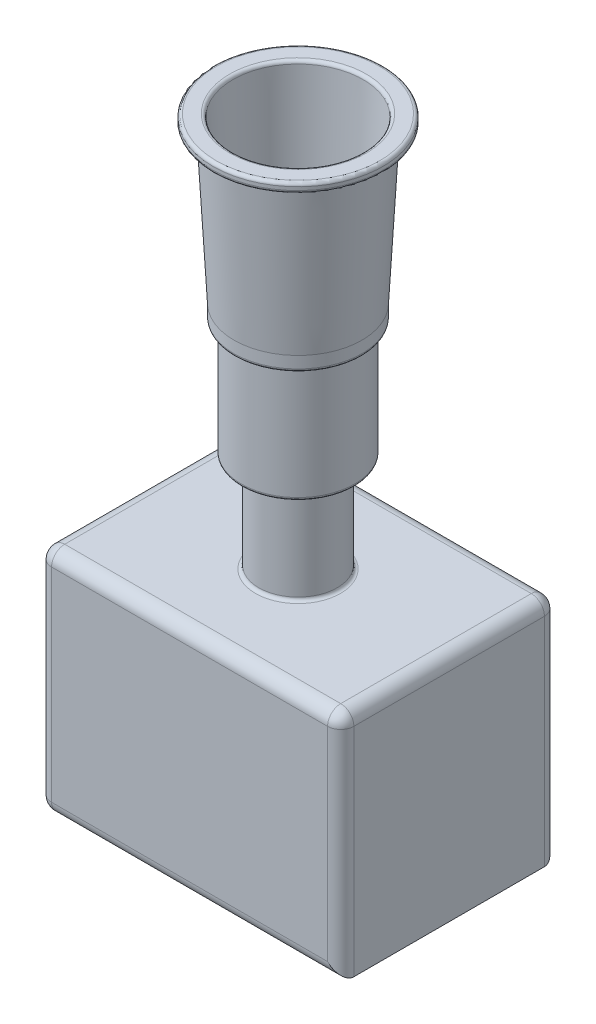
ISO-10303-21;
HEADER;
FILE_DESCRIPTION(('STEP AP214'),'2;1');
FILE_NAME('part.step','',(''),(''),'','','');
FILE_SCHEMA(('AUTOMOTIVE_DESIGN { 1 0 10303 214 1 1 1 1 }'));
ENDSEC;
DATA;
#1=APPLICATION_CONTEXT('core data for automotive mechanical design processes');
#2=APPLICATION_PROTOCOL_DEFINITION('international standard','automotive_design',2000,#1);
#3=PRODUCT_CONTEXT('',#1,'mechanical');
#4=PRODUCT('Part','Part','',(#3));
#5=PRODUCT_RELATED_PRODUCT_CATEGORY('part','',(#4));
#6=PRODUCT_DEFINITION_FORMATION('','',#4);
#7=PRODUCT_DEFINITION_CONTEXT('part definition',#1,'design');
#8=PRODUCT_DEFINITION('design','',#6,#7);
#9=PRODUCT_DEFINITION_SHAPE('','',#8);
#10=(LENGTH_UNIT() NAMED_UNIT(*) SI_UNIT(.MILLI.,.METRE.));
#11=(NAMED_UNIT(*) PLANE_ANGLE_UNIT() SI_UNIT($,.RADIAN.));
#12=(NAMED_UNIT(*) SI_UNIT($,.STERADIAN.) SOLID_ANGLE_UNIT());
#13=UNCERTAINTY_MEASURE_WITH_UNIT(LENGTH_MEASURE(1.E-05),#10,'distance_accuracy_value','');
#14=(GEOMETRIC_REPRESENTATION_CONTEXT(3) GLOBAL_UNCERTAINTY_ASSIGNED_CONTEXT((#13)) GLOBAL_UNIT_ASSIGNED_CONTEXT((#10,
#11,#12)) REPRESENTATION_CONTEXT('',''));
#15=CARTESIAN_POINT('',(0.,0.,0.));
#16=DIRECTION('',(0.,0.,1.));
#17=DIRECTION('',(1.,0.,0.));
#18=AXIS2_PLACEMENT_3D('',#15,#16,#17);
#19=CARTESIAN_POINT('',(-21.,2.,-14.5));
#20=DIRECTION('',(-0.577350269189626,-0.577350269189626,-0.577350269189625));
#21=DIRECTION('',(-0.707106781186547,0.707106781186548,0.));
#22=AXIS2_PLACEMENT_3D('',#19,#20,#21);
#23=SPHERICAL_SURFACE('',#22,2.);
#24=CARTESIAN_POINT('',(-22.1547005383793,0.845299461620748,-15.6547005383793));
#25=VERTEX_POINT('',#24);
#26=VERTEX_LOOP('',#25);
#27=FACE_BOUND('',#26,.T.);
#28=CARTESIAN_POINT('',(-21.,2.,-14.5));
#29=DIRECTION('',(0.,1.,0.));
#30=DIRECTION('',(0.,0.,1.));
#31=AXIS2_PLACEMENT_3D('',#28,#29,#30);
#32=CIRCLE('',#31,2.);
#33=CARTESIAN_POINT('',(-21.,2.,-16.5));
#34=VERTEX_POINT('',#33);
#35=CARTESIAN_POINT('',(-23.,2.,-14.5));
#36=VERTEX_POINT('',#35);
#37=EDGE_CURVE('E110',#34,#36,#32,.T.);
#38=ORIENTED_EDGE('',*,*,#37,.F.);
#39=CARTESIAN_POINT('',(-21.,2.,-14.5));
#40=DIRECTION('',(-1.,0.,0.));
#41=DIRECTION('',(0.,0.,1.));
#42=AXIS2_PLACEMENT_3D('',#39,#40,#41);
#43=CIRCLE('',#42,2.);
#44=CARTESIAN_POINT('',(-21.,0.,-14.5));
#45=VERTEX_POINT('',#44);
#46=EDGE_CURVE('E21',#45,#34,#43,.F.);
#47=ORIENTED_EDGE('',*,*,#46,.F.);
#48=CARTESIAN_POINT('',(-21.,2.,-14.5));
#49=DIRECTION('',(0.,0.,1.));
#50=DIRECTION('',(1.,0.,0.));
#51=AXIS2_PLACEMENT_3D('',#48,#49,#50);
#52=CIRCLE('',#51,2.);
#53=EDGE_CURVE('E107',#36,#45,#52,.T.);
#54=ORIENTED_EDGE('',*,*,#53,.F.);
#55=EDGE_LOOP('',(#38,#47,#54));
#56=FACE_BOUND('',#55,.T.);
#57=ADVANCED_FACE('F17',(#27,#56),#23,.T.);
#58=CARTESIAN_POINT('',(-21.,2.,14.5));
#59=DIRECTION('',(-0.577350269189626,-0.577350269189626,0.577350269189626));
#60=DIRECTION('',(-0.707106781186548,0.707106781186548,0.));
#61=AXIS2_PLACEMENT_3D('',#58,#59,#60);
#62=SPHERICAL_SURFACE('',#61,2.);
#63=CARTESIAN_POINT('',(-22.1547005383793,0.845299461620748,15.6547005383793));
#64=VERTEX_POINT('',#63);
#65=VERTEX_LOOP('',#64);
#66=FACE_BOUND('',#65,.T.);
#67=CARTESIAN_POINT('',(-21.,2.,14.5));
#68=DIRECTION('',(1.,0.,0.));
#69=DIRECTION('',(0.,0.,-1.));
#70=AXIS2_PLACEMENT_3D('',#67,#68,#69);
#71=CIRCLE('',#70,2.);
#72=CARTESIAN_POINT('',(-21.,2.,16.5));
#73=VERTEX_POINT('',#72);
#74=CARTESIAN_POINT('',(-21.,0.,14.5));
#75=VERTEX_POINT('',#74);
#76=EDGE_CURVE('E442',#73,#75,#71,.T.);
#77=ORIENTED_EDGE('',*,*,#76,.F.);
#78=CARTESIAN_POINT('',(-21.,2.,14.5));
#79=DIRECTION('',(0.,1.,0.));
#80=DIRECTION('',(0.,0.,1.));
#81=AXIS2_PLACEMENT_3D('',#78,#79,#80);
#82=CIRCLE('',#81,2.);
#83=CARTESIAN_POINT('',(-23.,2.,14.5));
#84=VERTEX_POINT('',#83);
#85=EDGE_CURVE('E439',#84,#73,#82,.T.);
#86=ORIENTED_EDGE('',*,*,#85,.F.);
#87=CARTESIAN_POINT('',(-21.,2.,14.5));
#88=DIRECTION('',(0.,0.,1.));
#89=DIRECTION('',(1.,0.,0.));
#90=AXIS2_PLACEMENT_3D('',#87,#88,#89);
#91=CIRCLE('',#90,2.);
#92=EDGE_CURVE('E132',#75,#84,#91,.F.);
#93=ORIENTED_EDGE('',*,*,#92,.F.);
#94=EDGE_LOOP('',(#77,#86,#93));
#95=FACE_BOUND('',#94,.T.);
#96=ADVANCED_FACE('F145',(#66,#95),#62,.T.);
#97=CARTESIAN_POINT('',(11.5,2.,-14.5));
#98=DIRECTION('',(-1.,0.,0.));
#99=DIRECTION('',(0.,0.,1.));
#100=AXIS2_PLACEMENT_3D('',#97,#98,#99);
#101=CYLINDRICAL_SURFACE('',#100,2.);
#102=CARTESIAN_POINT('',(21.,2.,-14.5));
#103=DIRECTION('',(0.707106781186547,0.707106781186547,0.));
#104=DIRECTION('',(-0.707106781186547,0.707106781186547,0.));
#105=AXIS2_PLACEMENT_3D('',#102,#103,#104);
#106=ELLIPSE('',#105,2.82842712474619,2.);
#107=CARTESIAN_POINT('',(23.,0.,-14.5));
#108=VERTEX_POINT('',#107);
#109=CARTESIAN_POINT('',(21.,2.,-16.5));
#110=VERTEX_POINT('',#109);
#111=EDGE_CURVE('E117',#108,#110,#106,.T.);
#112=ORIENTED_EDGE('',*,*,#111,.F.);
#113=DIRECTION('',(1.,0.,0.));
#114=VECTOR('',#113,1.);
#115=CARTESIAN_POINT('',(0.,0.,-14.5));
#116=LINE('',#115,#114);
#117=EDGE_CURVE('E114',#108,#45,#116,.F.);
#118=ORIENTED_EDGE('',*,*,#117,.T.);
#119=ORIENTED_EDGE('',*,*,#46,.T.);
#120=DIRECTION('',(-1.,0.,0.));
#121=VECTOR('',#120,1.);
#122=CARTESIAN_POINT('',(23.,2.,-16.5));
#123=LINE('',#122,#121);
#124=EDGE_CURVE('E135',#110,#34,#123,.T.);
#125=ORIENTED_EDGE('',*,*,#124,.F.);
#126=EDGE_LOOP('',(#112,#118,#119,#125));
#127=FACE_BOUND('',#126,.T.);
#128=ADVANCED_FACE('F115',(#127),#101,.T.);
#129=CARTESIAN_POINT('',(-21.,2.,-8.25));
#130=DIRECTION('',(0.,0.,1.));
#131=DIRECTION('',(1.,0.,0.));
#132=AXIS2_PLACEMENT_3D('',#129,#130,#131);
#133=CYLINDRICAL_SURFACE('',#132,2.);
#134=ORIENTED_EDGE('',*,*,#92,.T.);
#135=DIRECTION('',(0.,0.,1.));
#136=VECTOR('',#135,1.);
#137=CARTESIAN_POINT('',(-23.,2.,-16.5));
#138=LINE('',#137,#136);
#139=EDGE_CURVE('E131',#36,#84,#138,.T.);
#140=ORIENTED_EDGE('',*,*,#139,.F.);
#141=ORIENTED_EDGE('',*,*,#53,.T.);
#142=DIRECTION('',(0.,0.,1.));
#143=VECTOR('',#142,1.);
#144=CARTESIAN_POINT('',(-21.,0.,0.));
#145=LINE('',#144,#143);
#146=EDGE_CURVE('E122',#45,#75,#145,.T.);
#147=ORIENTED_EDGE('',*,*,#146,.T.);
#148=EDGE_LOOP('',(#134,#140,#141,#147));
#149=FACE_BOUND('',#148,.T.);
#150=ADVANCED_FACE('F128',(#149),#133,.T.);
#151=CARTESIAN_POINT('',(-21.,0.,-14.5));
#152=DIRECTION('',(0.,1.,0.));
#153=DIRECTION('',(0.,0.,1.));
#154=AXIS2_PLACEMENT_3D('',#151,#152,#153);
#155=CYLINDRICAL_SURFACE('',#154,2.);
#156=CARTESIAN_POINT('',(-21.,33.,-14.5));
#157=DIRECTION('',(0.,1.,0.));
#158=DIRECTION('',(0.,0.,1.));
#159=AXIS2_PLACEMENT_3D('',#156,#157,#158);
#160=CIRCLE('',#159,2.);
#161=CARTESIAN_POINT('',(-21.,33.,-16.5));
#162=VERTEX_POINT('',#161);
#163=CARTESIAN_POINT('',(-23.,33.,-14.5));
#164=VERTEX_POINT('',#163);
#165=EDGE_CURVE('E419',#162,#164,#160,.T.);
#166=ORIENTED_EDGE('',*,*,#165,.F.);
#167=DIRECTION('',(0.,1.,0.));
#168=VECTOR('',#167,1.);
#169=CARTESIAN_POINT('',(-21.,0.,-16.5));
#170=LINE('',#169,#168);
#171=EDGE_CURVE('E420',#34,#162,#170,.T.);
#172=ORIENTED_EDGE('',*,*,#171,.F.);
#173=ORIENTED_EDGE('',*,*,#37,.T.);
#174=DIRECTION('',(0.,1.,0.));
#175=VECTOR('',#174,1.);
#176=CARTESIAN_POINT('',(-23.,0.,-14.5));
#177=LINE('',#176,#175);
#178=EDGE_CURVE('E404',#164,#36,#177,.F.);
#179=ORIENTED_EDGE('',*,*,#178,.F.);
#180=EDGE_LOOP('',(#166,#172,#173,#179));
#181=FACE_BOUND('',#180,.T.);
#182=ADVANCED_FACE('F850',(#181),#155,.T.);
#183=CARTESIAN_POINT('',(-11.5,2.,14.5));
#184=DIRECTION('',(1.,0.,0.));
#185=DIRECTION('',(0.,0.,-1.));
#186=AXIS2_PLACEMENT_3D('',#183,#184,#185);
#187=CYLINDRICAL_SURFACE('',#186,2.);
#188=CARTESIAN_POINT('',(21.,2.,14.5));
#189=DIRECTION('',(0.707106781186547,0.707106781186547,0.));
#190=DIRECTION('',(-0.707106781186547,0.707106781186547,0.));
#191=AXIS2_PLACEMENT_3D('',#188,#189,#190);
#192=ELLIPSE('',#191,2.82842712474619,2.);
#193=CARTESIAN_POINT('',(21.,2.,16.5));
#194=VERTEX_POINT('',#193);
#195=CARTESIAN_POINT('',(23.,0.,14.5));
#196=VERTEX_POINT('',#195);
#197=EDGE_CURVE('E426',#194,#196,#192,.T.);
#198=ORIENTED_EDGE('',*,*,#197,.F.);
#199=DIRECTION('',(1.,0.,0.));
#200=VECTOR('',#199,1.);
#201=CARTESIAN_POINT('',(-23.,2.,16.5));
#202=LINE('',#201,#200);
#203=EDGE_CURVE('E427',#73,#194,#202,.T.);
#204=ORIENTED_EDGE('',*,*,#203,.F.);
#205=ORIENTED_EDGE('',*,*,#76,.T.);
#206=DIRECTION('',(1.,0.,0.));
#207=VECTOR('',#206,1.);
#208=CARTESIAN_POINT('',(0.,0.,14.5));
#209=LINE('',#208,#207);
#210=EDGE_CURVE('E123',#75,#196,#209,.T.);
#211=ORIENTED_EDGE('',*,*,#210,.T.);
#212=EDGE_LOOP('',(#198,#204,#205,#211));
#213=FACE_BOUND('',#212,.T.);
#214=ADVANCED_FACE('F858',(#213),#187,.T.);
#215=CARTESIAN_POINT('',(-21.,0.,14.5));
#216=DIRECTION('',(0.,1.,0.));
#217=DIRECTION('',(0.,0.,1.));
#218=AXIS2_PLACEMENT_3D('',#215,#216,#217);
#219=CYLINDRICAL_SURFACE('',#218,2.);
#220=CARTESIAN_POINT('',(-21.,33.,14.5));
#221=DIRECTION('',(0.,1.,0.));
#222=DIRECTION('',(0.,0.,1.));
#223=AXIS2_PLACEMENT_3D('',#220,#221,#222);
#224=CIRCLE('',#223,2.);
#225=CARTESIAN_POINT('',(-23.,33.,14.5));
#226=VERTEX_POINT('',#225);
#227=CARTESIAN_POINT('',(-21.,33.,16.5));
#228=VERTEX_POINT('',#227);
#229=EDGE_CURVE('E407',#226,#228,#224,.T.);
#230=ORIENTED_EDGE('',*,*,#229,.F.);
#231=DIRECTION('',(0.,1.,0.));
#232=VECTOR('',#231,1.);
#233=CARTESIAN_POINT('',(-23.,0.,14.5));
#234=LINE('',#233,#232);
#235=EDGE_CURVE('E408',#84,#226,#234,.T.);
#236=ORIENTED_EDGE('',*,*,#235,.F.);
#237=ORIENTED_EDGE('',*,*,#85,.T.);
#238=DIRECTION('',(0.,1.,0.));
#239=VECTOR('',#238,1.);
#240=CARTESIAN_POINT('',(-21.,0.,16.5));
#241=LINE('',#240,#239);
#242=EDGE_CURVE('E473',#228,#73,#241,.F.);
#243=ORIENTED_EDGE('',*,*,#242,.F.);
#244=EDGE_LOOP('',(#230,#236,#237,#243));
#245=FACE_BOUND('',#244,.T.);
#246=ADVANCED_FACE('F449',(#245),#219,.T.);
#247=CARTESIAN_POINT('',(21.,0.,14.5));
#248=DIRECTION('',(0.,1.,0.));
#249=DIRECTION('',(0.,0.,1.));
#250=AXIS2_PLACEMENT_3D('',#247,#248,#249);
#251=CYLINDRICAL_SURFACE('',#250,2.);
#252=DIRECTION('',(0.,1.,0.));
#253=VECTOR('',#252,1.);
#254=CARTESIAN_POINT('',(21.,0.,16.5));
#255=LINE('',#254,#253);
#256=CARTESIAN_POINT('',(21.,33.,16.5));
#257=VERTEX_POINT('',#256);
#258=EDGE_CURVE('E397',#194,#257,#255,.T.);
#259=ORIENTED_EDGE('',*,*,#258,.F.);
#260=ORIENTED_EDGE('',*,*,#197,.T.);
#261=DIRECTION('',(0.,1.,0.));
#262=VECTOR('',#261,1.);
#263=CARTESIAN_POINT('',(23.,0.,14.5));
#264=LINE('',#263,#262);
#265=CARTESIAN_POINT('',(23.,33.,14.5));
#266=VERTEX_POINT('',#265);
#267=EDGE_CURVE('E364',#266,#196,#264,.F.);
#268=ORIENTED_EDGE('',*,*,#267,.F.);
#269=CARTESIAN_POINT('',(21.,33.,14.5));
#270=DIRECTION('',(0.,1.,0.));
#271=DIRECTION('',(0.,0.,1.));
#272=AXIS2_PLACEMENT_3D('',#269,#270,#271);
#273=CIRCLE('',#272,2.);
#274=EDGE_CURVE('E469',#257,#266,#273,.T.);
#275=ORIENTED_EDGE('',*,*,#274,.F.);
#276=EDGE_LOOP('',(#259,#260,#268,#275));
#277=FACE_BOUND('',#276,.T.);
#278=ADVANCED_FACE('F739',(#277),#251,.T.);
#279=CARTESIAN_POINT('',(0.,0.,0.));
#280=DIRECTION('',(0.,1.,0.));
#281=DIRECTION('',(0.,0.,1.));
#282=AXIS2_PLACEMENT_3D('',#279,#280,#281);
#283=PLANE('',#282);
#284=ORIENTED_EDGE('',*,*,#117,.F.);
#285=DIRECTION('',(0.,0.,-1.));
#286=VECTOR('',#285,1.);
#287=CARTESIAN_POINT('',(23.,0.,16.5));
#288=LINE('',#287,#286);
#289=EDGE_CURVE('E370',#196,#108,#288,.T.);
#290=ORIENTED_EDGE('',*,*,#289,.F.);
#291=ORIENTED_EDGE('',*,*,#210,.F.);
#292=ORIENTED_EDGE('',*,*,#146,.F.);
#293=EDGE_LOOP('',(#284,#290,#291,#292));
#294=FACE_BOUND('',#293,.T.);
#295=ADVANCED_FACE('F133',(#294),#283,.F.);
#296=CARTESIAN_POINT('',(21.,0.,-14.5));
#297=DIRECTION('',(0.,1.,0.));
#298=DIRECTION('',(0.,0.,1.));
#299=AXIS2_PLACEMENT_3D('',#296,#297,#298);
#300=CYLINDRICAL_SURFACE('',#299,2.);
#301=DIRECTION('',(0.,1.,0.));
#302=VECTOR('',#301,1.);
#303=CARTESIAN_POINT('',(23.,0.,-14.5));
#304=LINE('',#303,#302);
#305=CARTESIAN_POINT('',(23.,33.,-14.5));
#306=VERTEX_POINT('',#305);
#307=EDGE_CURVE('E366',#108,#306,#304,.T.);
#308=ORIENTED_EDGE('',*,*,#307,.F.);
#309=ORIENTED_EDGE('',*,*,#111,.T.);
#310=DIRECTION('',(0.,1.,0.));
#311=VECTOR('',#310,1.);
#312=CARTESIAN_POINT('',(21.,0.,-16.5));
#313=LINE('',#312,#311);
#314=CARTESIAN_POINT('',(21.,33.,-16.5));
#315=VERTEX_POINT('',#314);
#316=EDGE_CURVE('E416',#315,#110,#313,.F.);
#317=ORIENTED_EDGE('',*,*,#316,.F.);
#318=CARTESIAN_POINT('',(21.,33.,-14.5));
#319=DIRECTION('',(0.,1.,0.));
#320=DIRECTION('',(0.,0.,1.));
#321=AXIS2_PLACEMENT_3D('',#318,#319,#320);
#322=CIRCLE('',#321,2.);
#323=EDGE_CURVE('E471',#306,#315,#322,.T.);
#324=ORIENTED_EDGE('',*,*,#323,.F.);
#325=EDGE_LOOP('',(#308,#309,#317,#324));
#326=FACE_BOUND('',#325,.T.);
#327=ADVANCED_FACE('F727',(#326),#300,.T.);
#328=CARTESIAN_POINT('',(23.,0.,-16.5));
#329=DIRECTION('',(0.,0.,-1.));
#330=DIRECTION('',(-1.,0.,0.));
#331=AXIS2_PLACEMENT_3D('',#328,#329,#330);
#332=PLANE('',#331);
#333=DIRECTION('',(-1.,0.,0.));
#334=VECTOR('',#333,1.);
#335=CARTESIAN_POINT('',(11.5,33.,-16.5));
#336=LINE('',#335,#334);
#337=EDGE_CURVE('E411',#315,#162,#336,.T.);
#338=ORIENTED_EDGE('',*,*,#337,.F.);
#339=ORIENTED_EDGE('',*,*,#316,.T.);
#340=ORIENTED_EDGE('',*,*,#124,.T.);
#341=ORIENTED_EDGE('',*,*,#171,.T.);
#342=EDGE_LOOP('',(#338,#339,#340,#341));
#343=FACE_BOUND('',#342,.T.);
#344=ADVANCED_FACE('F391',(#343),#332,.T.);
#345=CARTESIAN_POINT('',(-21.,33.,-14.5));
#346=DIRECTION('',(-0.577350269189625,0.577350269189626,-0.577350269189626));
#347=DIRECTION('',(0.,-0.707106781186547,-0.707106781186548));
#348=AXIS2_PLACEMENT_3D('',#345,#346,#347);
#349=SPHERICAL_SURFACE('',#348,2.);
#350=CARTESIAN_POINT('',(-22.1547005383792,34.1547005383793,-15.6547005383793));
#351=VERTEX_POINT('',#350);
#352=VERTEX_LOOP('',#351);
#353=FACE_BOUND('',#352,.T.);
#354=ORIENTED_EDGE('',*,*,#165,.T.);
#355=CARTESIAN_POINT('',(-21.,33.,-14.5));
#356=DIRECTION('',(0.,0.,1.));
#357=DIRECTION('',(1.,0.,0.));
#358=AXIS2_PLACEMENT_3D('',#355,#356,#357);
#359=CIRCLE('',#358,2.);
#360=CARTESIAN_POINT('',(-21.,35.,-14.5));
#361=VERTEX_POINT('',#360);
#362=EDGE_CURVE('E403',#361,#164,#359,.T.);
#363=ORIENTED_EDGE('',*,*,#362,.F.);
#364=CARTESIAN_POINT('',(-21.,33.,-14.5));
#365=DIRECTION('',(-1.,0.,0.));
#366=DIRECTION('',(0.,0.,1.));
#367=AXIS2_PLACEMENT_3D('',#364,#365,#366);
#368=CIRCLE('',#367,2.);
#369=EDGE_CURVE('E369',#162,#361,#368,.F.);
#370=ORIENTED_EDGE('',*,*,#369,.F.);
#371=EDGE_LOOP('',(#354,#363,#370));
#372=FACE_BOUND('',#371,.T.);
#373=ADVANCED_FACE('F386',(#353,#372),#349,.T.);
#374=CARTESIAN_POINT('',(-23.,0.,-16.5));
#375=DIRECTION('',(-1.,0.,0.));
#376=DIRECTION('',(0.,0.,1.));
#377=AXIS2_PLACEMENT_3D('',#374,#375,#376);
#378=PLANE('',#377);
#379=DIRECTION('',(0.,0.,1.));
#380=VECTOR('',#379,1.);
#381=CARTESIAN_POINT('',(-23.,33.,-8.25));
#382=LINE('',#381,#380);
#383=EDGE_CURVE('E399',#164,#226,#382,.T.);
#384=ORIENTED_EDGE('',*,*,#383,.F.);
#385=ORIENTED_EDGE('',*,*,#178,.T.);
#386=ORIENTED_EDGE('',*,*,#139,.T.);
#387=ORIENTED_EDGE('',*,*,#235,.T.);
#388=EDGE_LOOP('',(#384,#385,#386,#387));
#389=FACE_BOUND('',#388,.T.);
#390=ADVANCED_FACE('F382',(#389),#378,.T.);
#391=CARTESIAN_POINT('',(-21.,33.,14.5));
#392=DIRECTION('',(-0.577350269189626,0.577350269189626,0.577350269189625));
#393=DIRECTION('',(0.,0.707106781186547,-0.707106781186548));
#394=AXIS2_PLACEMENT_3D('',#391,#392,#393);
#395=SPHERICAL_SURFACE('',#394,2.);
#396=CARTESIAN_POINT('',(-22.1547005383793,34.1547005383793,15.6547005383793));
#397=VERTEX_POINT('',#396);
#398=VERTEX_LOOP('',#397);
#399=FACE_BOUND('',#398,.T.);
#400=ORIENTED_EDGE('',*,*,#229,.T.);
#401=CARTESIAN_POINT('',(-21.,33.,14.5));
#402=DIRECTION('',(1.,0.,0.));
#403=DIRECTION('',(0.,0.,-1.));
#404=AXIS2_PLACEMENT_3D('',#401,#402,#403);
#405=CIRCLE('',#404,2.);
#406=CARTESIAN_POINT('',(-21.,35.,14.5));
#407=VERTEX_POINT('',#406);
#408=EDGE_CURVE('E483',#407,#228,#405,.T.);
#409=ORIENTED_EDGE('',*,*,#408,.F.);
#410=CARTESIAN_POINT('',(-21.,33.,14.5));
#411=DIRECTION('',(0.,0.,1.));
#412=DIRECTION('',(1.,0.,0.));
#413=AXIS2_PLACEMENT_3D('',#410,#411,#412);
#414=CIRCLE('',#413,2.);
#415=EDGE_CURVE('E414',#226,#407,#414,.F.);
#416=ORIENTED_EDGE('',*,*,#415,.F.);
#417=EDGE_LOOP('',(#400,#409,#416));
#418=FACE_BOUND('',#417,.T.);
#419=ADVANCED_FACE('F379',(#399,#418),#395,.T.);
#420=CARTESIAN_POINT('',(-23.,0.,16.5));
#421=DIRECTION('',(0.,0.,1.));
#422=DIRECTION('',(1.,0.,0.));
#423=AXIS2_PLACEMENT_3D('',#420,#421,#422);
#424=PLANE('',#423);
#425=DIRECTION('',(1.,0.,0.));
#426=VECTOR('',#425,1.);
#427=CARTESIAN_POINT('',(-11.5,33.,16.5));
#428=LINE('',#427,#426);
#429=EDGE_CURVE('E480',#228,#257,#428,.T.);
#430=ORIENTED_EDGE('',*,*,#429,.F.);
#431=ORIENTED_EDGE('',*,*,#242,.T.);
#432=ORIENTED_EDGE('',*,*,#203,.T.);
#433=ORIENTED_EDGE('',*,*,#258,.T.);
#434=EDGE_LOOP('',(#430,#431,#432,#433));
#435=FACE_BOUND('',#434,.T.);
#436=ADVANCED_FACE('F358',(#435),#424,.T.);
#437=CARTESIAN_POINT('',(21.,33.,-14.5));
#438=DIRECTION('',(0.577350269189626,0.577350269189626,-0.577350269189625));
#439=DIRECTION('',(0.,-0.707106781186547,-0.707106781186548));
#440=AXIS2_PLACEMENT_3D('',#437,#438,#439);
#441=SPHERICAL_SURFACE('',#440,2.);
#442=CARTESIAN_POINT('',(22.1547005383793,34.1547005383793,-15.6547005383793));
#443=VERTEX_POINT('',#442);
#444=VERTEX_LOOP('',#443);
#445=FACE_BOUND('',#444,.T.);
#446=ORIENTED_EDGE('',*,*,#323,.T.);
#447=CARTESIAN_POINT('',(21.,33.,-14.5));
#448=DIRECTION('',(-1.,0.,0.));
#449=DIRECTION('',(0.,0.,1.));
#450=AXIS2_PLACEMENT_3D('',#447,#448,#449);
#451=CIRCLE('',#450,2.);
#452=CARTESIAN_POINT('',(21.,35.,-14.5));
#453=VERTEX_POINT('',#452);
#454=EDGE_CURVE('E415',#453,#315,#451,.T.);
#455=ORIENTED_EDGE('',*,*,#454,.F.);
#456=CARTESIAN_POINT('',(21.,33.,-14.5));
#457=DIRECTION('',(0.,0.,-1.));
#458=DIRECTION('',(-1.,0.,0.));
#459=AXIS2_PLACEMENT_3D('',#456,#457,#458);
#460=CIRCLE('',#459,2.);
#461=EDGE_CURVE('E482',#306,#453,#460,.F.);
#462=ORIENTED_EDGE('',*,*,#461,.F.);
#463=EDGE_LOOP('',(#446,#455,#462));
#464=FACE_BOUND('',#463,.T.);
#465=ADVANCED_FACE('F352',(#445,#464),#441,.T.);
#466=CARTESIAN_POINT('',(21.,33.,14.5));
#467=DIRECTION('',(0.577350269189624,0.577350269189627,0.577350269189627));
#468=DIRECTION('',(0.,0.707106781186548,-0.707106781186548));
#469=AXIS2_PLACEMENT_3D('',#466,#467,#468);
#470=SPHERICAL_SURFACE('',#469,2.);
#471=CARTESIAN_POINT('',(22.1547005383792,34.1547005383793,15.6547005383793));
#472=VERTEX_POINT('',#471);
#473=VERTEX_LOOP('',#472);
#474=FACE_BOUND('',#473,.T.);
#475=ORIENTED_EDGE('',*,*,#274,.T.);
#476=CARTESIAN_POINT('',(21.,33.,14.5));
#477=DIRECTION('',(0.,0.,-1.));
#478=DIRECTION('',(-1.,0.,0.));
#479=AXIS2_PLACEMENT_3D('',#476,#477,#478);
#480=CIRCLE('',#479,2.);
#481=CARTESIAN_POINT('',(21.,35.,14.5));
#482=VERTEX_POINT('',#481);
#483=EDGE_CURVE('E488',#482,#266,#480,.T.);
#484=ORIENTED_EDGE('',*,*,#483,.F.);
#485=CARTESIAN_POINT('',(21.,33.,14.5));
#486=DIRECTION('',(1.,0.,0.));
#487=DIRECTION('',(0.,0.,-1.));
#488=AXIS2_PLACEMENT_3D('',#485,#486,#487);
#489=CIRCLE('',#488,2.);
#490=EDGE_CURVE('E402',#257,#482,#489,.F.);
#491=ORIENTED_EDGE('',*,*,#490,.F.);
#492=EDGE_LOOP('',(#475,#484,#491));
#493=FACE_BOUND('',#492,.T.);
#494=ADVANCED_FACE('F347',(#474,#493),#470,.T.);
#495=CARTESIAN_POINT('',(23.,0.,16.5));
#496=DIRECTION('',(1.,0.,0.));
#497=DIRECTION('',(0.,0.,-1.));
#498=AXIS2_PLACEMENT_3D('',#495,#496,#497);
#499=PLANE('',#498);
#500=ORIENTED_EDGE('',*,*,#307,.T.);
#501=DIRECTION('',(0.,0.,-1.));
#502=VECTOR('',#501,1.);
#503=CARTESIAN_POINT('',(23.,33.,8.25));
#504=LINE('',#503,#502);
#505=EDGE_CURVE('E375',#266,#306,#504,.T.);
#506=ORIENTED_EDGE('',*,*,#505,.F.);
#507=ORIENTED_EDGE('',*,*,#267,.T.);
#508=ORIENTED_EDGE('',*,*,#289,.T.);
#509=EDGE_LOOP('',(#500,#506,#507,#508));
#510=FACE_BOUND('',#509,.T.);
#511=ADVANCED_FACE('F351',(#510),#499,.T.);
#512=CARTESIAN_POINT('',(11.5,33.,-14.5));
#513=DIRECTION('',(-1.,0.,0.));
#514=DIRECTION('',(0.,0.,1.));
#515=AXIS2_PLACEMENT_3D('',#512,#513,#514);
#516=CYLINDRICAL_SURFACE('',#515,2.);
#517=ORIENTED_EDGE('',*,*,#454,.T.);
#518=ORIENTED_EDGE('',*,*,#337,.T.);
#519=ORIENTED_EDGE('',*,*,#369,.T.);
#520=DIRECTION('',(1.,0.,0.));
#521=VECTOR('',#520,1.);
#522=CARTESIAN_POINT('',(0.,35.,-14.5));
#523=LINE('',#522,#521);
#524=EDGE_CURVE('E371',#453,#361,#523,.F.);
#525=ORIENTED_EDGE('',*,*,#524,.F.);
#526=EDGE_LOOP('',(#517,#518,#519,#525));
#527=FACE_BOUND('',#526,.T.);
#528=ADVANCED_FACE('F692',(#527),#516,.T.);
#529=CARTESIAN_POINT('',(-21.,33.,-8.25));
#530=DIRECTION('',(0.,0.,1.));
#531=DIRECTION('',(1.,0.,0.));
#532=AXIS2_PLACEMENT_3D('',#529,#530,#531);
#533=CYLINDRICAL_SURFACE('',#532,2.);
#534=ORIENTED_EDGE('',*,*,#362,.T.);
#535=ORIENTED_EDGE('',*,*,#383,.T.);
#536=ORIENTED_EDGE('',*,*,#415,.T.);
#537=DIRECTION('',(0.,0.,1.));
#538=VECTOR('',#537,1.);
#539=CARTESIAN_POINT('',(-21.,35.,0.));
#540=LINE('',#539,#538);
#541=EDGE_CURVE('E374',#361,#407,#540,.T.);
#542=ORIENTED_EDGE('',*,*,#541,.F.);
#543=EDGE_LOOP('',(#534,#535,#536,#542));
#544=FACE_BOUND('',#543,.T.);
#545=ADVANCED_FACE('F456',(#544),#533,.T.);
#546=CARTESIAN_POINT('',(-11.5,33.,14.5));
#547=DIRECTION('',(1.,0.,0.));
#548=DIRECTION('',(0.,0.,-1.));
#549=AXIS2_PLACEMENT_3D('',#546,#547,#548);
#550=CYLINDRICAL_SURFACE('',#549,2.);
#551=ORIENTED_EDGE('',*,*,#408,.T.);
#552=ORIENTED_EDGE('',*,*,#429,.T.);
#553=ORIENTED_EDGE('',*,*,#490,.T.);
#554=DIRECTION('',(1.,0.,0.));
#555=VECTOR('',#554,1.);
#556=CARTESIAN_POINT('',(0.,35.,14.5));
#557=LINE('',#556,#555);
#558=EDGE_CURVE('E844',#407,#482,#557,.T.);
#559=ORIENTED_EDGE('',*,*,#558,.F.);
#560=EDGE_LOOP('',(#551,#552,#553,#559));
#561=FACE_BOUND('',#560,.T.);
#562=ADVANCED_FACE('F804',(#561),#550,.T.);
#563=CARTESIAN_POINT('',(21.,33.,8.25));
#564=DIRECTION('',(0.,0.,-1.));
#565=DIRECTION('',(-1.,0.,0.));
#566=AXIS2_PLACEMENT_3D('',#563,#564,#565);
#567=CYLINDRICAL_SURFACE('',#566,2.);
#568=ORIENTED_EDGE('',*,*,#483,.T.);
#569=ORIENTED_EDGE('',*,*,#505,.T.);
#570=ORIENTED_EDGE('',*,*,#461,.T.);
#571=DIRECTION('',(0.,0.,1.));
#572=VECTOR('',#571,1.);
#573=CARTESIAN_POINT('',(21.,35.,0.));
#574=LINE('',#573,#572);
#575=EDGE_CURVE('E344',#482,#453,#574,.F.);
#576=ORIENTED_EDGE('',*,*,#575,.F.);
#577=EDGE_LOOP('',(#568,#569,#570,#576));
#578=FACE_BOUND('',#577,.T.);
#579=ADVANCED_FACE('F680',(#578),#567,.T.);
#580=CARTESIAN_POINT('',(0.,35.,0.));
#581=DIRECTION('',(0.,1.,0.));
#582=DIRECTION('',(0.,0.,1.));
#583=AXIS2_PLACEMENT_3D('',#580,#581,#582);
#584=PLANE('',#583);
#585=CARTESIAN_POINT('',(0.,35.,0.));
#586=DIRECTION('',(0.,1.,0.));
#587=DIRECTION('',(0.,0.,1.));
#588=AXIS2_PLACEMENT_3D('',#585,#586,#587);
#589=CIRCLE('',#588,6.47186619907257);
#590=CARTESIAN_POINT('',(0.,35.,6.47186619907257));
#591=VERTEX_POINT('',#590);
#592=EDGE_CURVE('E921',#591,#591,#589,.F.);
#593=ORIENTED_EDGE('',*,*,#592,.T.);
#594=EDGE_LOOP('',(#593));
#595=FACE_BOUND('',#594,.T.);
#596=ORIENTED_EDGE('',*,*,#558,.T.);
#597=ORIENTED_EDGE('',*,*,#575,.T.);
#598=ORIENTED_EDGE('',*,*,#524,.T.);
#599=ORIENTED_EDGE('',*,*,#541,.T.);
#600=EDGE_LOOP('',(#596,#597,#598,#599));
#601=FACE_BOUND('',#600,.T.);
#602=ADVANCED_FACE('F327',(#595,#601),#584,.T.);
#603=CARTESIAN_POINT('',(0.,46.9694233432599,-1.79744431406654));
#604=DIRECTION('',(-1.,0.,0.));
#605=DIRECTION('',(0.,0.,1.));
#606=AXIS2_PLACEMENT_3D('',#603,#604,#605);
#607=CIRCLE('',#606,25.2795620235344);
#608=TRIMMED_CURVE('',#607,(PARAMETER_VALUE(-1.49963361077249)),
(PARAMETER_VALUE(1.49963361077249)),.T.,.PARAMETER.);
#609=CARTESIAN_POINT('',(0.,46.9694233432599,0.));
#610=DIRECTION('',(0.,1.,0.));
#611=AXIS1_PLACEMENT('',#609,#610);
#612=SURFACE_OF_REVOLUTION('',#608,#611);
#613=CARTESIAN_POINT('',(0.,70.0000000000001,0.));
#614=DIRECTION('',(0.,1.,0.));
#615=DIRECTION('',(0.,0.,1.));
#616=AXIS2_PLACEMENT_3D('',#613,#614,#615);
#617=CIRCLE('',#616,8.62602895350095);
#618=CARTESIAN_POINT('',(0.,70.0000000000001,8.62602895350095));
#619=VERTEX_POINT('',#618);
#620=EDGE_CURVE('E314',#619,#619,#617,.T.);
#621=ORIENTED_EDGE('',*,*,#620,.T.);
#622=EDGE_LOOP('',(#621));
#623=FACE_BOUND('',#622,.T.);
#624=CARTESIAN_POINT('',(0.,72.1850028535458,0.));
#625=VERTEX_POINT('',#624);
#626=VERTEX_LOOP('',#625);
#627=FACE_BOUND('',#626,.T.);
#628=ADVANCED_FACE('F19',(#623,#627),#612,.T.);
#629=CARTESIAN_POINT('',(0.,35.5,0.));
#630=DIRECTION('',(0.,-1.,0.));
#631=DIRECTION('',(0.,0.,-1.));
#632=AXIS2_PLACEMENT_3D('',#629,#630,#631);
#633=TOROIDAL_SURFACE('',#632,6.47186619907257,0.5);
#634=ORIENTED_EDGE('',*,*,#592,.F.);
#635=EDGE_LOOP('',(#634));
#636=FACE_BOUND('',#635,.T.);
#637=CARTESIAN_POINT('',(0.,35.5,0.));
#638=DIRECTION('',(0.,1.,0.));
#639=DIRECTION('',(0.,0.,1.));
#640=AXIS2_PLACEMENT_3D('',#637,#638,#639);
#641=CIRCLE('',#640,5.97186619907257);
#642=CARTESIAN_POINT('',(0.,35.5,5.97186619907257));
#643=VERTEX_POINT('',#642);
#644=EDGE_CURVE('E297',#643,#643,#641,.T.);
#645=ORIENTED_EDGE('',*,*,#644,.F.);
#646=EDGE_LOOP('',(#645));
#647=FACE_BOUND('',#646,.T.);
#648=ADVANCED_FACE('F321',(#636,#647),#633,.F.);
#649=CARTESIAN_POINT('',(0.,94.5261679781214,0.));
#650=DIRECTION('',(0.,1.,0.));
#651=DIRECTION('',(-1.,0.,0.));
#652=AXIS2_PLACEMENT_3D('',#649,#650,#651);
#653=CONICAL_SURFACE('',#652,9.91139095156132,0.0523598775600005);
#654=CARTESIAN_POINT('',(0.,94.5261679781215,0.));
#655=DIRECTION('',(0.,1.,0.));
#656=DIRECTION('',(0.,0.,1.));
#657=AXIS2_PLACEMENT_3D('',#654,#655,#656);
#658=CIRCLE('',#657,9.91139095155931);
#659=CARTESIAN_POINT('',(0.,94.5261679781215,9.91139095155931));
#660=VERTEX_POINT('',#659);
#661=EDGE_CURVE('E293',#660,#660,#658,.F.);
#662=ORIENTED_EDGE('',*,*,#661,.F.);
#663=EDGE_LOOP('',(#662));
#664=FACE_BOUND('',#663,.T.);
#665=ORIENTED_EDGE('',*,*,#620,.F.);
#666=EDGE_LOOP('',(#665));
#667=FACE_BOUND('',#666,.T.);
#668=ADVANCED_FACE('F325',(#664,#667),#653,.F.);
#669=CARTESIAN_POINT('',(0.,42.5,0.));
#670=DIRECTION('',(0.,1.,0.));
#671=DIRECTION('',(0.,0.,1.));
#672=AXIS2_PLACEMENT_3D('',#669,#670,#671);
#673=CYLINDRICAL_SURFACE('',#672,5.97186619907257);
#674=ORIENTED_EDGE('',*,*,#644,.T.);
#675=EDGE_LOOP('',(#674));
#676=FACE_BOUND('',#675,.T.);
#677=CARTESIAN_POINT('',(0.,50.,0.));
#678=DIRECTION('',(0.,1.,0.));
#679=DIRECTION('',(0.,0.,1.));
#680=AXIS2_PLACEMENT_3D('',#677,#678,#679);
#681=CIRCLE('',#680,5.97186619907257);
#682=CARTESIAN_POINT('',(0.,50.,5.97186619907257));
#683=VERTEX_POINT('',#682);
#684=EDGE_CURVE('E296',#683,#683,#681,.T.);
#685=ORIENTED_EDGE('',*,*,#684,.F.);
#686=EDGE_LOOP('',(#685));
#687=FACE_BOUND('',#686,.T.);
#688=ADVANCED_FACE('F285',(#676,#687),#673,.T.);
#689=CARTESIAN_POINT('',(0.,94.5,0.));
#690=DIRECTION('',(0.,1.,0.));
#691=DIRECTION('',(0.,0.,1.));
#692=AXIS2_PLACEMENT_3D('',#689,#690,#691);
#693=TOROIDAL_SURFACE('',#692,10.4107057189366,0.5);
#694=ORIENTED_EDGE('',*,*,#661,.T.);
#695=EDGE_LOOP('',(#694));
#696=FACE_BOUND('',#695,.T.);
#697=CARTESIAN_POINT('',(0.,95.,0.));
#698=DIRECTION('',(0.,1.,0.));
#699=DIRECTION('',(0.,0.,1.));
#700=AXIS2_PLACEMENT_3D('',#697,#698,#699);
#701=CIRCLE('',#700,10.4107057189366);
#702=CARTESIAN_POINT('',(0.,95.,10.4107057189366));
#703=VERTEX_POINT('',#702);
#704=EDGE_CURVE('E303',#703,#703,#701,.F.);
#705=ORIENTED_EDGE('',*,*,#704,.F.);
#706=EDGE_LOOP('',(#705));
#707=FACE_BOUND('',#706,.T.);
#708=ADVANCED_FACE('F279',(#696,#707),#693,.T.);
#709=CARTESIAN_POINT('',(0.,50.,7.29894757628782));
#710=DIRECTION('',(0.,-1.,0.));
#711=DIRECTION('',(0.,0.,-1.));
#712=AXIS2_PLACEMENT_3D('',#709,#710,#711);
#713=PLANE('',#712);
#714=CARTESIAN_POINT('',(0.,50.,0.));
#715=DIRECTION('',(0.,1.,0.));
#716=DIRECTION('',(0.,0.,1.));
#717=AXIS2_PLACEMENT_3D('',#714,#715,#716);
#718=CIRCLE('',#717,8.12602895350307);
#719=CARTESIAN_POINT('',(0.,50.,8.12602895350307));
#720=VERTEX_POINT('',#719);
#721=EDGE_CURVE('E263',#720,#720,#718,.T.);
#722=ORIENTED_EDGE('',*,*,#721,.F.);
#723=EDGE_LOOP('',(#722));
#724=FACE_BOUND('',#723,.T.);
#725=ORIENTED_EDGE('',*,*,#684,.T.);
#726=EDGE_LOOP('',(#725));
#727=FACE_BOUND('',#726,.T.);
#728=ADVANCED_FACE('F269',(#724,#727),#713,.T.);
#729=CARTESIAN_POINT('',(0.,95.,11.4362234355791));
#730=DIRECTION('',(0.,1.,0.));
#731=DIRECTION('',(0.,0.,1.));
#732=AXIS2_PLACEMENT_3D('',#729,#730,#731);
#733=PLANE('',#732);
#734=CARTESIAN_POINT('',(0.,95.,0.));
#735=DIRECTION('',(0.,-1.,0.));
#736=DIRECTION('',(0.,0.,1.));
#737=AXIS2_PLACEMENT_3D('',#734,#735,#736);
#738=CIRCLE('',#737,12.4362234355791);
#739=CARTESIAN_POINT('',(0.,95.,12.4362234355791));
#740=VERTEX_POINT('',#739);
#741=EDGE_CURVE('E229',#740,#740,#738,.T.);
#742=ORIENTED_EDGE('',*,*,#741,.F.);
#743=EDGE_LOOP('',(#742));
#744=FACE_BOUND('',#743,.T.);
#745=ORIENTED_EDGE('',*,*,#704,.T.);
#746=EDGE_LOOP('',(#745));
#747=FACE_BOUND('',#746,.T.);
#748=ADVANCED_FACE('F278',(#744,#747),#733,.T.);
#749=CARTESIAN_POINT('',(0.,50.5,0.));
#750=DIRECTION('',(0.,1.,0.));
#751=DIRECTION('',(0.,0.,1.));
#752=AXIS2_PLACEMENT_3D('',#749,#750,#751);
#753=TOROIDAL_SURFACE('',#752,8.12602895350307,0.5);
#754=CARTESIAN_POINT('',(0.,50.5,0.));
#755=DIRECTION('',(0.,1.,0.));
#756=DIRECTION('',(0.,0.,1.));
#757=AXIS2_PLACEMENT_3D('',#754,#755,#756);
#758=CIRCLE('',#757,8.62602895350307);
#759=CARTESIAN_POINT('',(0.,50.5,8.62602895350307));
#760=VERTEX_POINT('',#759);
#761=EDGE_CURVE('E224',#760,#760,#758,.T.);
#762=ORIENTED_EDGE('',*,*,#761,.F.);
#763=EDGE_LOOP('',(#762));
#764=FACE_BOUND('',#763,.T.);
#765=ORIENTED_EDGE('',*,*,#721,.T.);
#766=EDGE_LOOP('',(#765));
#767=FACE_BOUND('',#766,.T.);
#768=ADVANCED_FACE('F243',(#764,#767),#753,.T.);
#769=CARTESIAN_POINT('',(0.,94.5,0.));
#770=DIRECTION('',(0.,1.,0.));
#771=DIRECTION('',(0.,0.,1.));
#772=AXIS2_PLACEMENT_3D('',#769,#770,#771);
#773=TOROIDAL_SURFACE('',#772,12.4362234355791,0.5);
#774=ORIENTED_EDGE('',*,*,#741,.T.);
#775=EDGE_LOOP('',(#774));
#776=FACE_BOUND('',#775,.T.);
#777=CARTESIAN_POINT('',(0.,94.5,0.));
#778=DIRECTION('',(0.,1.,0.));
#779=DIRECTION('',(0.,0.,1.));
#780=AXIS2_PLACEMENT_3D('',#777,#778,#779);
#781=CIRCLE('',#780,12.9362234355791);
#782=CARTESIAN_POINT('',(0.,94.5,12.9362234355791));
#783=VERTEX_POINT('',#782);
#784=EDGE_CURVE('E219',#783,#783,#781,.F.);
#785=ORIENTED_EDGE('',*,*,#784,.F.);
#786=EDGE_LOOP('',(#785));
#787=FACE_BOUND('',#786,.T.);
#788=ADVANCED_FACE('F237',(#776,#787),#773,.T.);
#789=CARTESIAN_POINT('',(0.,68.8816875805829,0.));
#790=DIRECTION('',(0.,1.,0.));
#791=DIRECTION('',(0.,0.,1.));
#792=AXIS2_PLACEMENT_3D('',#789,#790,#791);
#793=CYLINDRICAL_SURFACE('',#792,8.62602895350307);
#794=ORIENTED_EDGE('',*,*,#761,.T.);
#795=EDGE_LOOP('',(#794));
#796=FACE_BOUND('',#795,.T.);
#797=CARTESIAN_POINT('',(0.,67.763375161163,0.));
#798=DIRECTION('',(0.,-1.,0.));
#799=DIRECTION('',(0.,0.,1.));
#800=AXIS2_PLACEMENT_3D('',#797,#798,#799);
#801=CIRCLE('',#800,8.62602895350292);
#802=CARTESIAN_POINT('',(0.,67.763375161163,8.62602895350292));
#803=VERTEX_POINT('',#802);
#804=EDGE_CURVE('E211',#803,#803,#801,.T.);
#805=ORIENTED_EDGE('',*,*,#804,.T.);
#806=EDGE_LOOP('',(#805));
#807=FACE_BOUND('',#806,.T.);
#808=ADVANCED_FACE('F242',(#796,#807),#793,.T.);
#809=CARTESIAN_POINT('',(0.,94.25,0.));
#810=DIRECTION('',(0.,1.,0.));
#811=DIRECTION('',(0.,0.,1.));
#812=AXIS2_PLACEMENT_3D('',#809,#810,#811);
#813=CYLINDRICAL_SURFACE('',#812,12.9362234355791);
#814=ORIENTED_EDGE('',*,*,#784,.T.);
#815=EDGE_LOOP('',(#814));
#816=FACE_BOUND('',#815,.T.);
#817=CARTESIAN_POINT('',(0.,94.,0.));
#818=DIRECTION('',(0.,1.,0.));
#819=DIRECTION('',(0.,0.,1.));
#820=AXIS2_PLACEMENT_3D('',#817,#818,#819);
#821=CIRCLE('',#820,12.9362234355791);
#822=CARTESIAN_POINT('',(0.,94.,12.9362234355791));
#823=VERTEX_POINT('',#822);
#824=EDGE_CURVE('E192',#823,#823,#821,.F.);
#825=ORIENTED_EDGE('',*,*,#824,.F.);
#826=EDGE_LOOP('',(#825));
#827=FACE_BOUND('',#826,.T.);
#828=ADVANCED_FACE('F513',(#816,#827),#813,.T.);
#829=CARTESIAN_POINT('',(0.,67.7328348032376,0.));
#830=DIRECTION('',(0.,-1.,0.));
#831=DIRECTION('',(0.,0.,-1.));
#832=AXIS2_PLACEMENT_3D('',#829,#830,#831);
#833=CONICAL_SURFACE('',#832,9.20877369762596,1.51843644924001);
#834=CARTESIAN_POINT('',(0.,67.7328348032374,0.));
#835=DIRECTION('',(0.,1.,0.));
#836=DIRECTION('',(0.,0.,1.));
#837=AXIS2_PLACEMENT_3D('',#834,#835,#836);
#838=CIRCLE('',#837,9.20877369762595);
#839=CARTESIAN_POINT('',(0.,67.7328348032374,9.20877369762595));
#840=VERTEX_POINT('',#839);
#841=EDGE_CURVE('E188',#840,#840,#838,.T.);
#842=ORIENTED_EDGE('',*,*,#841,.F.);
#843=EDGE_LOOP('',(#842));
#844=FACE_BOUND('',#843,.T.);
#845=ORIENTED_EDGE('',*,*,#804,.F.);
#846=EDGE_LOOP('',(#845));
#847=FACE_BOUND('',#846,.T.);
#848=ADVANCED_FACE('F202',(#844,#847),#833,.F.);
#849=CARTESIAN_POINT('',(0.,94.,0.));
#850=DIRECTION('',(0.,1.,0.));
#851=DIRECTION('',(0.,0.,1.));
#852=AXIS2_PLACEMENT_3D('',#849,#850,#851);
#853=TOROIDAL_SURFACE('',#852,12.4362234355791,0.5);
#854=ORIENTED_EDGE('',*,*,#824,.T.);
#855=EDGE_LOOP('',(#854));
#856=FACE_BOUND('',#855,.T.);
#857=CARTESIAN_POINT('',(0.,93.5,0.));
#858=DIRECTION('',(0.,1.,0.));
#859=DIRECTION('',(0.,0.,1.));
#860=AXIS2_PLACEMENT_3D('',#857,#858,#859);
#861=CIRCLE('',#860,12.4362234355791);
#862=CARTESIAN_POINT('',(0.,93.5,12.4362234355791));
#863=VERTEX_POINT('',#862);
#864=EDGE_CURVE('E191',#863,#863,#861,.F.);
#865=ORIENTED_EDGE('',*,*,#864,.F.);
#866=EDGE_LOOP('',(#865));
#867=FACE_BOUND('',#866,.T.);
#868=ADVANCED_FACE('F198',(#856,#867),#853,.T.);
#869=CARTESIAN_POINT('',(0.,68.2321495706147,0.));
#870=DIRECTION('',(0.,1.,0.));
#871=DIRECTION('',(0.,0.,1.));
#872=AXIS2_PLACEMENT_3D('',#869,#870,#871);
#873=TOROIDAL_SURFACE('',#872,9.23494167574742,0.5);
#874=CARTESIAN_POINT('',(0.,68.2321495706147,0.));
#875=DIRECTION('',(0.,1.,0.));
#876=DIRECTION('',(0.,0.,1.));
#877=AXIS2_PLACEMENT_3D('',#874,#875,#876);
#878=CIRCLE('',#877,9.73494167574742);
#879=CARTESIAN_POINT('',(0.,68.2321495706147,9.73494167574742));
#880=VERTEX_POINT('',#879);
#881=EDGE_CURVE('E495',#880,#880,#878,.T.);
#882=ORIENTED_EDGE('',*,*,#881,.F.);
#883=EDGE_LOOP('',(#882));
#884=FACE_BOUND('',#883,.T.);
#885=ORIENTED_EDGE('',*,*,#841,.T.);
#886=EDGE_LOOP('',(#885));
#887=FACE_BOUND('',#886,.T.);
#888=ADVANCED_FACE('F171',(#884,#887),#873,.T.);
#889=CARTESIAN_POINT('',(0.,93.5,11.951373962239));
#890=DIRECTION('',(0.,-1.,0.));
#891=DIRECTION('',(0.,0.,-1.));
#892=AXIS2_PLACEMENT_3D('',#889,#890,#891);
#893=PLANE('',#892);
#894=ORIENTED_EDGE('',*,*,#864,.T.);
#895=EDGE_LOOP('',(#894));
#896=FACE_BOUND('',#895,.T.);
#897=CARTESIAN_POINT('',(0.,93.4999999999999,0.));
#898=DIRECTION('',(0.,1.,0.));
#899=DIRECTION('',(0.,0.,1.));
#900=AXIS2_PLACEMENT_3D('',#897,#898,#899);
#901=CIRCLE('',#900,10.9665244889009);
#902=CARTESIAN_POINT('',(0.,93.4999999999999,10.9665244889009));
#903=VERTEX_POINT('',#902);
#904=EDGE_CURVE('E27',#903,#903,#901,.F.);
#905=ORIENTED_EDGE('',*,*,#904,.F.);
#906=EDGE_LOOP('',(#905));
#907=FACE_BOUND('',#906,.T.);
#908=ADVANCED_FACE('F163',(#896,#907),#893,.T.);
#909=CARTESIAN_POINT('',(0.,68.8526297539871,0.));
#910=DIRECTION('',(0.,1.,0.));
#911=DIRECTION('',(0.,0.,1.));
#912=AXIS2_PLACEMENT_3D('',#909,#910,#911);
#913=CYLINDRICAL_SURFACE('',#912,9.73494167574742);
#914=ORIENTED_EDGE('',*,*,#881,.T.);
#915=EDGE_LOOP('',(#914));
#916=FACE_BOUND('',#915,.T.);
#917=CARTESIAN_POINT('',(0.,70.0000000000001,0.));
#918=DIRECTION('',(0.,1.,0.));
#919=DIRECTION('',(0.,0.,1.));
#920=AXIS2_PLACEMENT_3D('',#917,#918,#919);
#921=CIRCLE('',#920,9.73494167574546);
#922=CARTESIAN_POINT('',(0.,70.0000000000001,9.73494167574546));
#923=VERTEX_POINT('',#922);
#924=EDGE_CURVE('E10',#923,#923,#921,.T.);
#925=ORIENTED_EDGE('',*,*,#924,.F.);
#926=EDGE_LOOP('',(#925));
#927=FACE_BOUND('',#926,.T.);
#928=ADVANCED_FACE('F157',(#916,#927),#913,.T.);
#929=CARTESIAN_POINT('',(0.,93.4999999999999,0.));
#930=DIRECTION('',(0.,1.,0.));
#931=DIRECTION('',(0.,0.,1.));
#932=AXIS2_PLACEMENT_3D('',#929,#930,#931);
#933=CONICAL_SURFACE('',#932,10.9665244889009,0.0523598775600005);
#934=ORIENTED_EDGE('',*,*,#924,.T.);
#935=EDGE_LOOP('',(#934));
#936=FACE_BOUND('',#935,.T.);
#937=ORIENTED_EDGE('',*,*,#904,.T.);
#938=EDGE_LOOP('',(#937));
#939=FACE_BOUND('',#938,.T.);
#940=ADVANCED_FACE('F155',(#936,#939),#933,.T.);
#941=CLOSED_SHELL('',(#57,#96,#128,#150,#182,#214,#246,#278,#295,#327,#344,#373,#390,#419,#436,
#465,#494,#511,#528,#545,#562,#579,#602,#628,#648,#668,#688,#708,#728,#748,#768,#788,#808,#828,
#848,#868,#888,#908,#928,#940));
#942=MANIFOLD_SOLID_BREP('B1',#941);
#943=ADVANCED_BREP_SHAPE_REPRESENTATION('',(#18,#942),#14);
#944=SHAPE_DEFINITION_REPRESENTATION(#9,#943);
ENDSEC;
END-ISO-10303-21;
